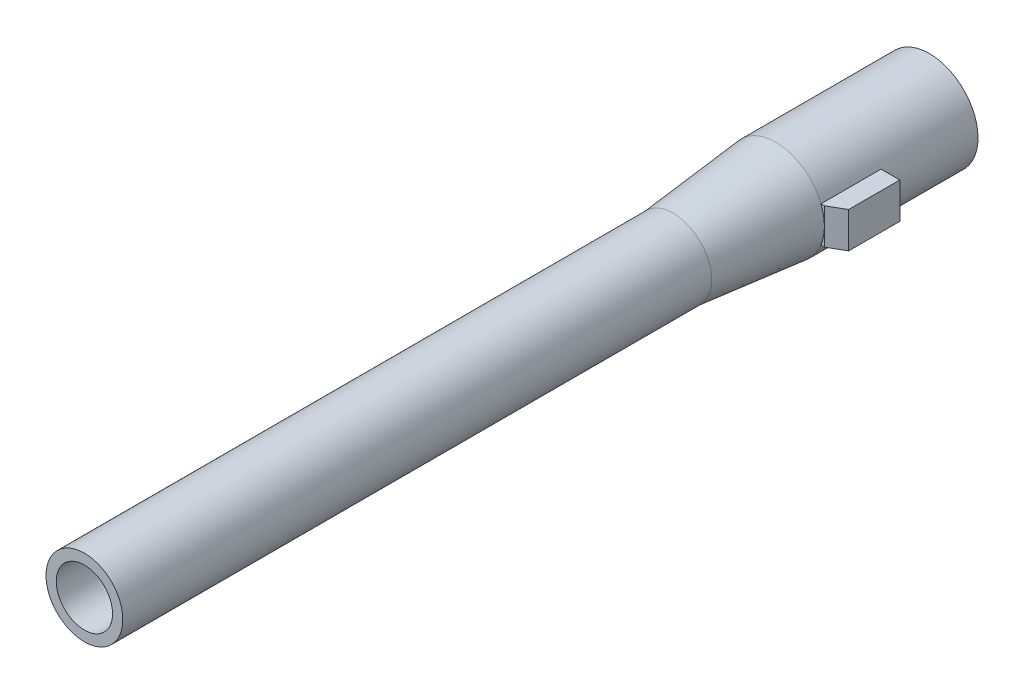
ISO-10303-21;
HEADER;
FILE_DESCRIPTION(('STEP AP214'),'2;1');
FILE_NAME('part.step','',(''),(''),'','','');
FILE_SCHEMA(('AUTOMOTIVE_DESIGN { 1 0 10303 214 1 1 1 1 }'));
ENDSEC;
DATA;
#1=APPLICATION_CONTEXT('core data for automotive mechanical design processes');
#2=APPLICATION_PROTOCOL_DEFINITION('international standard','automotive_design',2000,#1);
#3=PRODUCT_CONTEXT('',#1,'mechanical');
#4=PRODUCT('Part','Part','',(#3));
#5=PRODUCT_RELATED_PRODUCT_CATEGORY('part','',(#4));
#6=PRODUCT_DEFINITION_FORMATION('','',#4);
#7=PRODUCT_DEFINITION_CONTEXT('part definition',#1,'design');
#8=PRODUCT_DEFINITION('design','',#6,#7);
#9=PRODUCT_DEFINITION_SHAPE('','',#8);
#10=(LENGTH_UNIT() NAMED_UNIT(*) SI_UNIT(.MILLI.,.METRE.));
#11=(NAMED_UNIT(*) PLANE_ANGLE_UNIT() SI_UNIT($,.RADIAN.));
#12=(NAMED_UNIT(*) SI_UNIT($,.STERADIAN.) SOLID_ANGLE_UNIT());
#13=UNCERTAINTY_MEASURE_WITH_UNIT(LENGTH_MEASURE(1.E-05),#10,'distance_accuracy_value','');
#14=(GEOMETRIC_REPRESENTATION_CONTEXT(3) GLOBAL_UNCERTAINTY_ASSIGNED_CONTEXT((#13)) GLOBAL_UNIT_ASSIGNED_CONTEXT((#10,
#11,#12)) REPRESENTATION_CONTEXT('',''));
#15=CARTESIAN_POINT('',(0.,0.,0.));
#16=DIRECTION('',(0.,0.,1.));
#17=DIRECTION('',(1.,0.,0.));
#18=AXIS2_PLACEMENT_3D('',#15,#16,#17);
#19=CARTESIAN_POINT('',(0.,0.,30.));
#20=DIRECTION('',(0.,0.,-1.));
#21=DIRECTION('',(-1.,0.,0.));
#22=AXIS2_PLACEMENT_3D('',#19,#20,#21);
#23=CYLINDRICAL_SURFACE('',#22,9.5);
#24=CARTESIAN_POINT('',(0.,0.,0.));
#25=DIRECTION('',(0.,0.,1.));
#26=DIRECTION('',(1.,0.,0.));
#27=AXIS2_PLACEMENT_3D('',#24,#25,#26);
#28=CIRCLE('',#27,9.5);
#29=CARTESIAN_POINT('',(9.5,0.,0.));
#30=VERTEX_POINT('',#29);
#31=EDGE_CURVE('E38',#30,#30,#28,.T.);
#32=ORIENTED_EDGE('',*,*,#31,.T.);
#33=EDGE_LOOP('',(#32));
#34=FACE_BOUND('',#33,.T.);
#35=DIRECTION('',(0.,0.,-1.));
#36=VECTOR('',#35,1.);
#37=CARTESIAN_POINT('',(8.83176086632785,-3.5,30.));
#38=LINE('',#37,#36);
#39=CARTESIAN_POINT('',(8.83176086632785,-3.5,30.));
#40=VERTEX_POINT('',#39);
#41=CARTESIAN_POINT('',(8.83176086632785,-3.5,18.2679491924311));
#42=VERTEX_POINT('',#41);
#43=EDGE_CURVE('E127',#40,#42,#38,.T.);
#44=ORIENTED_EDGE('',*,*,#43,.F.);
#45=CARTESIAN_POINT('',(0.,0.,30.));
#46=DIRECTION('',(0.,0.,1.));
#47=DIRECTION('',(1.,0.,0.));
#48=AXIS2_PLACEMENT_3D('',#45,#46,#47);
#49=CIRCLE('',#48,9.5);
#50=CARTESIAN_POINT('',(8.83176086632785,3.5,30.));
#51=VERTEX_POINT('',#50);
#52=EDGE_CURVE('E43',#51,#40,#49,.T.);
#53=ORIENTED_EDGE('',*,*,#52,.F.);
#54=DIRECTION('',(0.,0.,-1.));
#55=VECTOR('',#54,1.);
#56=CARTESIAN_POINT('',(8.83176086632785,3.5,30.));
#57=LINE('',#56,#55);
#58=CARTESIAN_POINT('',(8.83176086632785,3.5,18.2679491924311));
#59=VERTEX_POINT('',#58);
#60=EDGE_CURVE('E101',#51,#59,#57,.T.);
#61=ORIENTED_EDGE('',*,*,#60,.T.);
#62=CARTESIAN_POINT('',(0.,0.,18.2679491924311));
#63=DIRECTION('',(0.,0.,-1.));
#64=DIRECTION('',(-1.,0.,0.));
#65=AXIS2_PLACEMENT_3D('',#62,#63,#64);
#66=CIRCLE('',#65,9.5);
#67=EDGE_CURVE('E129',#59,#42,#66,.T.);
#68=ORIENTED_EDGE('',*,*,#67,.T.);
#69=EDGE_LOOP('',(#44,#53,#61,#68));
#70=FACE_BOUND('',#69,.T.);
#71=ADVANCED_FACE('F35',(#34,#70),#23,.T.);
#72=CARTESIAN_POINT('',(0.,0.,0.));
#73=DIRECTION('',(0.,0.,1.));
#74=DIRECTION('',(1.,0.,0.));
#75=AXIS2_PLACEMENT_3D('',#72,#73,#74);
#76=PLANE('',#75);
#77=ORIENTED_EDGE('',*,*,#31,.F.);
#78=EDGE_LOOP('',(#77));
#79=FACE_BOUND('',#78,.T.);
#80=CARTESIAN_POINT('',(0.,0.,0.));
#81=DIRECTION('',(0.,0.,1.));
#82=DIRECTION('',(1.,0.,0.));
#83=AXIS2_PLACEMENT_3D('',#80,#81,#82);
#84=CIRCLE('',#83,7.6);
#85=CARTESIAN_POINT('',(7.6,0.,0.));
#86=VERTEX_POINT('',#85);
#87=EDGE_CURVE('E144',#86,#86,#84,.T.);
#88=ORIENTED_EDGE('',*,*,#87,.T.);
#89=EDGE_LOOP('',(#88));
#90=FACE_BOUND('',#89,.T.);
#91=ADVANCED_FACE('F178',(#79,#90),#76,.F.);
#92=CARTESIAN_POINT('',(0.,0.,30.));
#93=DIRECTION('',(0.,0.,-1.));
#94=DIRECTION('',(-1.,0.,0.));
#95=AXIS2_PLACEMENT_3D('',#92,#93,#94);
#96=CYLINDRICAL_SURFACE('',#95,7.6);
#97=CARTESIAN_POINT('',(0.,0.,30.));
#98=DIRECTION('',(0.,0.,-1.));
#99=DIRECTION('',(-1.,0.,0.));
#100=AXIS2_PLACEMENT_3D('',#97,#98,#99);
#101=CIRCLE('',#100,7.6);
#102=CARTESIAN_POINT('',(-7.6,0.,30.));
#103=VERTEX_POINT('',#102);
#104=EDGE_CURVE('E231',#103,#103,#101,.T.);
#105=ORIENTED_EDGE('',*,*,#104,.F.);
#106=EDGE_LOOP('',(#105));
#107=FACE_BOUND('',#106,.T.);
#108=ORIENTED_EDGE('',*,*,#87,.F.);
#109=EDGE_LOOP('',(#108));
#110=FACE_BOUND('',#109,.T.);
#111=ADVANCED_FACE('F184',(#107,#110),#96,.F.);
#112=CARTESIAN_POINT('',(0.,0.,30.));
#113=DIRECTION('',(0.,0.,-1.));
#114=DIRECTION('',(-1.,0.,0.));
#115=AXIS2_PLACEMENT_3D('',#112,#113,#114);
#116=CYLINDRICAL_SURFACE('',#115,7.49999999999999);
#117=CARTESIAN_POINT('',(0.,0.,50.));
#118=DIRECTION('',(0.,0.,-1.));
#119=DIRECTION('',(-1.,0.,0.));
#120=AXIS2_PLACEMENT_3D('',#117,#118,#119);
#121=CIRCLE('',#120,7.5);
#122=CARTESIAN_POINT('',(-7.5,0.,50.));
#123=VERTEX_POINT('',#122);
#124=EDGE_CURVE('E132',#123,#123,#121,.T.);
#125=ORIENTED_EDGE('',*,*,#124,.F.);
#126=EDGE_LOOP('',(#125));
#127=FACE_BOUND('',#126,.T.);
#128=CARTESIAN_POINT('',(0.,0.,165.));
#129=DIRECTION('',(0.,0.,-1.));
#130=DIRECTION('',(-1.,0.,0.));
#131=AXIS2_PLACEMENT_3D('',#128,#129,#130);
#132=CIRCLE('',#131,7.49999999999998);
#133=CARTESIAN_POINT('',(-7.49999999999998,0.,165.));
#134=VERTEX_POINT('',#133);
#135=EDGE_CURVE('E141',#134,#134,#132,.T.);
#136=ORIENTED_EDGE('',*,*,#135,.T.);
#137=EDGE_LOOP('',(#136));
#138=FACE_BOUND('',#137,.T.);
#139=ADVANCED_FACE('F189',(#127,#138),#116,.T.);
#140=CARTESIAN_POINT('',(0.,0.,165.));
#141=DIRECTION('',(0.,0.,-1.));
#142=DIRECTION('',(-1.,0.,0.));
#143=AXIS2_PLACEMENT_3D('',#140,#141,#142);
#144=PLANE('',#143);
#145=ORIENTED_EDGE('',*,*,#135,.F.);
#146=EDGE_LOOP('',(#145));
#147=FACE_BOUND('',#146,.T.);
#148=CARTESIAN_POINT('',(0.,0.,165.));
#149=DIRECTION('',(0.,0.,-1.));
#150=DIRECTION('',(-1.,0.,0.));
#151=AXIS2_PLACEMENT_3D('',#148,#149,#150);
#152=CIRCLE('',#151,5.49999999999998);
#153=CARTESIAN_POINT('',(-5.49999999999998,0.,165.));
#154=VERTEX_POINT('',#153);
#155=EDGE_CURVE('E138',#154,#154,#152,.T.);
#156=ORIENTED_EDGE('',*,*,#155,.T.);
#157=EDGE_LOOP('',(#156));
#158=FACE_BOUND('',#157,.T.);
#159=ADVANCED_FACE('F195',(#147,#158),#144,.F.);
#160=CARTESIAN_POINT('',(0.,0.,142.80777));
#161=DIRECTION('',(0.,0.,1.));
#162=DIRECTION('',(1.,0.,0.));
#163=AXIS2_PLACEMENT_3D('',#160,#161,#162);
#164=CONICAL_SURFACE('',#163,4.99999999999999,0.0225265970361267);
#165=ORIENTED_EDGE('',*,*,#155,.F.);
#166=EDGE_LOOP('',(#165));
#167=FACE_BOUND('',#166,.T.);
#168=CARTESIAN_POINT('',(0.,0.,142.80777));
#169=DIRECTION('',(0.,0.,-1.));
#170=DIRECTION('',(-1.,0.,0.));
#171=AXIS2_PLACEMENT_3D('',#168,#169,#170);
#172=CIRCLE('',#171,4.99999999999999);
#173=CARTESIAN_POINT('',(-4.99999999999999,0.,142.80777));
#174=VERTEX_POINT('',#173);
#175=EDGE_CURVE('E135',#174,#174,#172,.T.);
#176=ORIENTED_EDGE('',*,*,#175,.T.);
#177=EDGE_LOOP('',(#176));
#178=FACE_BOUND('',#177,.T.);
#179=ADVANCED_FACE('F199',(#167,#178),#164,.F.);
#180=CARTESIAN_POINT('',(0.,0.,142.80777));
#181=DIRECTION('',(0.,0.,-1.));
#182=DIRECTION('',(-1.,0.,0.));
#183=AXIS2_PLACEMENT_3D('',#180,#181,#182);
#184=CONICAL_SURFACE('',#183,4.99999999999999,0.00664838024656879);
#185=CARTESIAN_POINT('',(0.,0.,31.8623820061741));
#186=DIRECTION('',(0.,0.,-1.));
#187=DIRECTION('',(-1.,0.,0.));
#188=AXIS2_PLACEMENT_3D('',#185,#186,#187);
#189=CIRCLE('',#188,5.73761799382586);
#190=CARTESIAN_POINT('',(-5.73761799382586,0.,31.8623820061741));
#191=VERTEX_POINT('',#190);
#192=EDGE_CURVE('E102',#191,#191,#189,.T.);
#193=ORIENTED_EDGE('',*,*,#192,.T.);
#194=EDGE_LOOP('',(#193));
#195=FACE_BOUND('',#194,.T.);
#196=ORIENTED_EDGE('',*,*,#175,.F.);
#197=EDGE_LOOP('',(#196));
#198=FACE_BOUND('',#197,.T.);
#199=ADVANCED_FACE('F203',(#195,#198),#184,.F.);
#200=CARTESIAN_POINT('',(0.,0.,50.));
#201=DIRECTION('',(0.,0.,-1.));
#202=DIRECTION('',(-1.,0.,0.));
#203=AXIS2_PLACEMENT_3D('',#200,#201,#202);
#204=CONICAL_SURFACE('',#203,7.5,0.0996686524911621);
#205=CARTESIAN_POINT('',(9.5,0.,30.));
#206=VERTEX_POINT('',#205);
#207=EDGE_CURVE('E11',#206,#51,#49,.T.);
#208=ORIENTED_EDGE('',*,*,#207,.T.);
#209=ORIENTED_EDGE('',*,*,#52,.T.);
#210=EDGE_CURVE('E44',#40,#206,#49,.T.);
#211=ORIENTED_EDGE('',*,*,#210,.T.);
#212=EDGE_LOOP('',(#208,#209,#211));
#213=FACE_BOUND('',#212,.T.);
#214=ORIENTED_EDGE('',*,*,#124,.T.);
#215=EDGE_LOOP('',(#214));
#216=FACE_BOUND('',#215,.T.);
#217=ADVANCED_FACE('F153',(#213,#216),#204,.T.);
#218=CARTESIAN_POINT('',(9.5,-3.5,18.2679491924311));
#219=DIRECTION('',(0.,0.,-1.));
#220=DIRECTION('',(-1.,0.,0.));
#221=AXIS2_PLACEMENT_3D('',#218,#219,#220);
#222=PLANE('',#221);
#223=ORIENTED_EDGE('',*,*,#67,.F.);
#224=DIRECTION('',(-1.,0.,0.));
#225=VECTOR('',#224,1.);
#226=CARTESIAN_POINT('',(12.5,3.5,18.2679491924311));
#227=LINE('',#226,#225);
#228=CARTESIAN_POINT('',(12.5,3.5,18.2679491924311));
#229=VERTEX_POINT('',#228);
#230=EDGE_CURVE('E109',#229,#59,#227,.T.);
#231=ORIENTED_EDGE('',*,*,#230,.F.);
#232=DIRECTION('',(0.,1.,0.));
#233=VECTOR('',#232,1.);
#234=CARTESIAN_POINT('',(12.5,-3.5,18.2679491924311));
#235=LINE('',#234,#233);
#236=CARTESIAN_POINT('',(12.5,-3.5,18.2679491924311));
#237=VERTEX_POINT('',#236);
#238=EDGE_CURVE('E123',#237,#229,#235,.T.);
#239=ORIENTED_EDGE('',*,*,#238,.F.);
#240=DIRECTION('',(-1.,0.,0.));
#241=VECTOR('',#240,1.);
#242=CARTESIAN_POINT('',(12.5,-3.5,18.2679491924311));
#243=LINE('',#242,#241);
#244=EDGE_CURVE('E91',#237,#42,#243,.T.);
#245=ORIENTED_EDGE('',*,*,#244,.T.);
#246=EDGE_LOOP('',(#223,#231,#239,#245));
#247=FACE_BOUND('',#246,.T.);
#248=ADVANCED_FACE('F163',(#247),#222,.T.);
#249=CARTESIAN_POINT('',(7.6,-3.5,30.));
#250=DIRECTION('',(0.,0.,1.));
#251=DIRECTION('',(1.,0.,0.));
#252=AXIS2_PLACEMENT_3D('',#249,#250,#251);
#253=PLANE('',#252);
#254=ORIENTED_EDGE('',*,*,#207,.F.);
#255=DIRECTION('',(0.,1.,0.));
#256=VECTOR('',#255,1.);
#257=CARTESIAN_POINT('',(9.5,-3.5,30.));
#258=LINE('',#257,#256);
#259=CARTESIAN_POINT('',(9.5,3.5,30.));
#260=VERTEX_POINT('',#259);
#261=EDGE_CURVE('E84',#206,#260,#258,.T.);
#262=ORIENTED_EDGE('',*,*,#261,.T.);
#263=DIRECTION('',(1.,0.,0.));
#264=VECTOR('',#263,1.);
#265=CARTESIAN_POINT('',(7.6,3.5,30.));
#266=LINE('',#265,#264);
#267=EDGE_CURVE('E87',#51,#260,#266,.T.);
#268=ORIENTED_EDGE('',*,*,#267,.F.);
#269=EDGE_LOOP('',(#254,#262,#268));
#270=FACE_BOUND('',#269,.T.);
#271=ADVANCED_FACE('F86',(#270),#253,.T.);
#272=ORIENTED_EDGE('',*,*,#210,.F.);
#273=DIRECTION('',(1.,0.,0.));
#274=VECTOR('',#273,1.);
#275=CARTESIAN_POINT('',(7.6,-3.5,30.));
#276=LINE('',#275,#274);
#277=CARTESIAN_POINT('',(9.5,-3.5,30.));
#278=VERTEX_POINT('',#277);
#279=EDGE_CURVE('E114',#40,#278,#276,.T.);
#280=ORIENTED_EDGE('',*,*,#279,.T.);
#281=EDGE_CURVE('E51',#278,#206,#258,.T.);
#282=ORIENTED_EDGE('',*,*,#281,.T.);
#283=EDGE_LOOP('',(#272,#280,#282));
#284=FACE_BOUND('',#283,.T.);
#285=ADVANCED_FACE('F211',(#284),#253,.T.);
#286=CARTESIAN_POINT('',(0.,-3.5,0.));
#287=DIRECTION('',(0.,1.,0.));
#288=DIRECTION('',(0.,0.,1.));
#289=AXIS2_PLACEMENT_3D('',#286,#287,#288);
#290=PLANE('',#289);
#291=ORIENTED_EDGE('',*,*,#279,.F.);
#292=ORIENTED_EDGE('',*,*,#43,.T.);
#293=ORIENTED_EDGE('',*,*,#244,.F.);
#294=DIRECTION('',(0.,0.,-1.));
#295=VECTOR('',#294,1.);
#296=CARTESIAN_POINT('',(12.5,-3.5,28.2679491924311));
#297=LINE('',#296,#295);
#298=CARTESIAN_POINT('',(12.5,-3.5,28.2679491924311));
#299=VERTEX_POINT('',#298);
#300=EDGE_CURVE('E118',#299,#237,#297,.T.);
#301=ORIENTED_EDGE('',*,*,#300,.F.);
#302=DIRECTION('',(0.866025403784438,0.,-0.500000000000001));
#303=VECTOR('',#302,1.);
#304=CARTESIAN_POINT('',(9.5,-3.5,30.));
#305=LINE('',#304,#303);
#306=EDGE_CURVE('E116',#278,#299,#305,.T.);
#307=ORIENTED_EDGE('',*,*,#306,.F.);
#308=EDGE_LOOP('',(#291,#292,#293,#301,#307));
#309=FACE_BOUND('',#308,.T.);
#310=ADVANCED_FACE('F159',(#309),#290,.F.);
#311=CARTESIAN_POINT('',(0.,3.5,0.));
#312=DIRECTION('',(0.,1.,0.));
#313=DIRECTION('',(0.,0.,1.));
#314=AXIS2_PLACEMENT_3D('',#311,#312,#313);
#315=PLANE('',#314);
#316=ORIENTED_EDGE('',*,*,#60,.F.);
#317=ORIENTED_EDGE('',*,*,#267,.T.);
#318=DIRECTION('',(0.866025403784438,0.,-0.500000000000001));
#319=VECTOR('',#318,1.);
#320=CARTESIAN_POINT('',(9.5,3.5,30.));
#321=LINE('',#320,#319);
#322=CARTESIAN_POINT('',(12.5,3.5,28.2679491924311));
#323=VERTEX_POINT('',#322);
#324=EDGE_CURVE('E97',#260,#323,#321,.T.);
#325=ORIENTED_EDGE('',*,*,#324,.T.);
#326=DIRECTION('',(0.,0.,-1.));
#327=VECTOR('',#326,1.);
#328=CARTESIAN_POINT('',(12.5,3.5,28.2679491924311));
#329=LINE('',#328,#327);
#330=EDGE_CURVE('E107',#323,#229,#329,.T.);
#331=ORIENTED_EDGE('',*,*,#330,.T.);
#332=ORIENTED_EDGE('',*,*,#230,.T.);
#333=EDGE_LOOP('',(#316,#317,#325,#331,#332));
#334=FACE_BOUND('',#333,.T.);
#335=ADVANCED_FACE('F95',(#334),#315,.T.);
#336=CARTESIAN_POINT('',(12.5,-3.5,28.2679491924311));
#337=DIRECTION('',(1.,0.,0.));
#338=DIRECTION('',(0.,0.,-1.));
#339=AXIS2_PLACEMENT_3D('',#336,#337,#338);
#340=PLANE('',#339);
#341=ORIENTED_EDGE('',*,*,#238,.T.);
#342=ORIENTED_EDGE('',*,*,#330,.F.);
#343=DIRECTION('',(0.,1.,0.));
#344=VECTOR('',#343,1.);
#345=CARTESIAN_POINT('',(12.5,-3.5,28.2679491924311));
#346=LINE('',#345,#344);
#347=EDGE_CURVE('E106',#299,#323,#346,.T.);
#348=ORIENTED_EDGE('',*,*,#347,.F.);
#349=ORIENTED_EDGE('',*,*,#300,.T.);
#350=EDGE_LOOP('',(#341,#342,#348,#349));
#351=FACE_BOUND('',#350,.T.);
#352=ADVANCED_FACE('F166',(#351),#340,.T.);
#353=CARTESIAN_POINT('',(9.5,-3.5,30.));
#354=DIRECTION('',(0.500000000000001,0.,0.866025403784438));
#355=DIRECTION('',(0.866025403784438,0.,-0.500000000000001));
#356=AXIS2_PLACEMENT_3D('',#353,#354,#355);
#357=PLANE('',#356);
#358=ORIENTED_EDGE('',*,*,#347,.T.);
#359=ORIENTED_EDGE('',*,*,#324,.F.);
#360=ORIENTED_EDGE('',*,*,#261,.F.);
#361=ORIENTED_EDGE('',*,*,#281,.F.);
#362=ORIENTED_EDGE('',*,*,#306,.T.);
#363=EDGE_LOOP('',(#358,#359,#360,#361,#362));
#364=FACE_BOUND('',#363,.T.);
#365=ADVANCED_FACE('F104',(#364),#357,.T.);
#366=CARTESIAN_POINT('',(0.,0.,30.));
#367=DIRECTION('',(0.,0.,-1.));
#368=DIRECTION('',(-1.,0.,0.));
#369=AXIS2_PLACEMENT_3D('',#366,#367,#368);
#370=CONICAL_SURFACE('',#369,7.6,0.785398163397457);
#371=ORIENTED_EDGE('',*,*,#192,.F.);
#372=EDGE_LOOP('',(#371));
#373=FACE_BOUND('',#372,.T.);
#374=ORIENTED_EDGE('',*,*,#104,.T.);
#375=EDGE_LOOP('',(#374));
#376=FACE_BOUND('',#375,.T.);
#377=ADVANCED_FACE('F173',(#373,#376),#370,.F.);
#378=CLOSED_SHELL('',(#71,#91,#111,#139,#159,#179,#199,#217,#248,#271,#285,#310,#335,#352,#365,#377));
#379=MANIFOLD_SOLID_BREP('B2',#378);
#380=ADVANCED_BREP_SHAPE_REPRESENTATION('',(#18,#379),#14);
#381=SHAPE_DEFINITION_REPRESENTATION(#9,#380);
ENDSEC;
END-ISO-10303-21;
